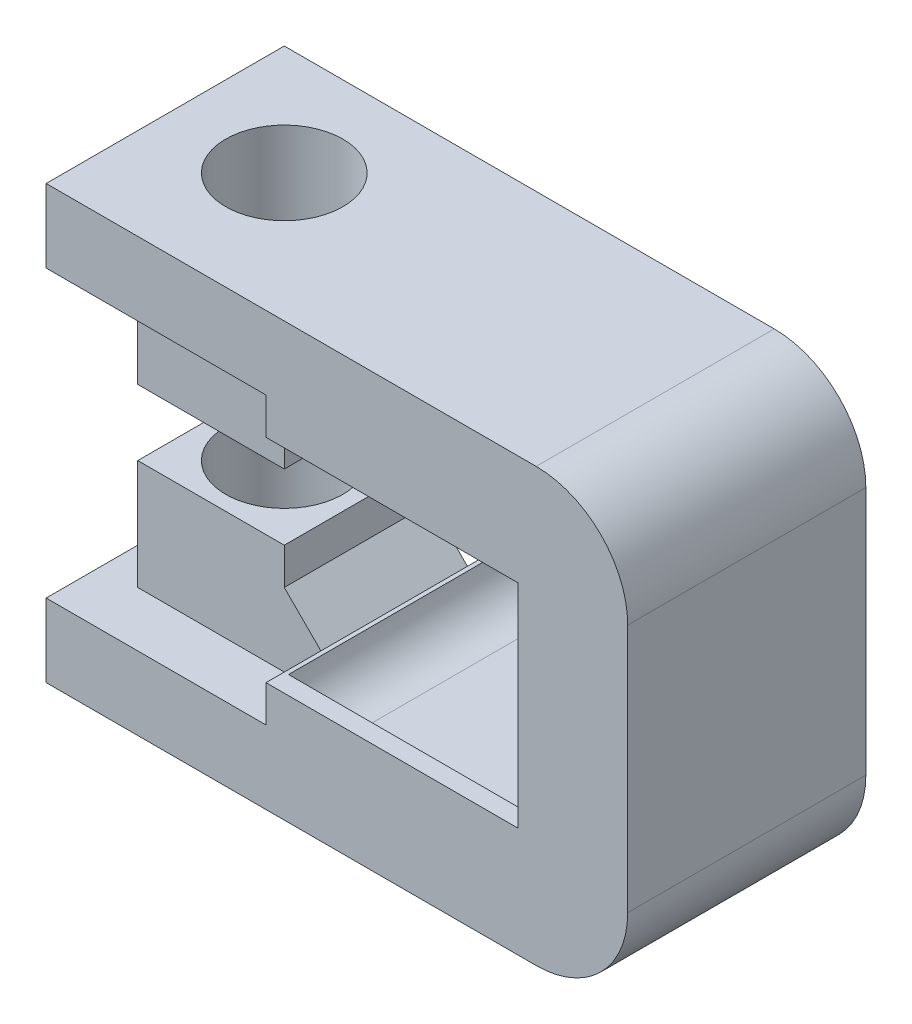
ISO-10303-21;
HEADER;
FILE_DESCRIPTION(('STEP AP214'),'2;1');
FILE_NAME('part.step','',(''),(''),'','','');
FILE_SCHEMA(('AUTOMOTIVE_DESIGN { 1 0 10303 214 1 1 1 1 }'));
ENDSEC;
DATA;
#1=APPLICATION_CONTEXT('core data for automotive mechanical design processes');
#2=APPLICATION_PROTOCOL_DEFINITION('international standard','automotive_design',2000,#1);
#3=PRODUCT_CONTEXT('',#1,'mechanical');
#4=PRODUCT('Part','Part','',(#3));
#5=PRODUCT_RELATED_PRODUCT_CATEGORY('part','',(#4));
#6=PRODUCT_DEFINITION_FORMATION('','',#4);
#7=PRODUCT_DEFINITION_CONTEXT('part definition',#1,'design');
#8=PRODUCT_DEFINITION('design','',#6,#7);
#9=PRODUCT_DEFINITION_SHAPE('','',#8);
#10=(LENGTH_UNIT() NAMED_UNIT(*) SI_UNIT(.MILLI.,.METRE.));
#11=(NAMED_UNIT(*) PLANE_ANGLE_UNIT() SI_UNIT($,.RADIAN.));
#12=(NAMED_UNIT(*) SI_UNIT($,.STERADIAN.) SOLID_ANGLE_UNIT());
#13=UNCERTAINTY_MEASURE_WITH_UNIT(LENGTH_MEASURE(1.E-05),#10,'distance_accuracy_value','');
#14=(GEOMETRIC_REPRESENTATION_CONTEXT(3) GLOBAL_UNCERTAINTY_ASSIGNED_CONTEXT((#13)) GLOBAL_UNIT_ASSIGNED_CONTEXT((#10,
#11,#12)) REPRESENTATION_CONTEXT('',''));
#15=CARTESIAN_POINT('',(0.,0.,0.));
#16=DIRECTION('',(0.,0.,1.));
#17=DIRECTION('',(1.,0.,0.));
#18=AXIS2_PLACEMENT_3D('',#15,#16,#17);
#19=CARTESIAN_POINT('',(-7.95000000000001,0.,-12.));
#20=DIRECTION('',(1.,0.,0.));
#21=DIRECTION('',(0.,0.,-1.));
#22=AXIS2_PLACEMENT_3D('',#19,#20,#21);
#23=PLANE('',#22);
#24=DIRECTION('',(0.,1.,0.));
#25=VECTOR('',#24,1.);
#26=CARTESIAN_POINT('',(-7.95,-2.44621125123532,-2.));
#27=LINE('',#26,#25);
#28=CARTESIAN_POINT('',(-7.95000000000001,5.8,-2.));
#29=VERTEX_POINT('',#28);
#30=CARTESIAN_POINT('',(-7.95000000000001,7.8,-2.));
#31=VERTEX_POINT('',#30);
#32=EDGE_CURVE('E567',#29,#31,#27,.T.);
#33=ORIENTED_EDGE('',*,*,#32,.F.);
#34=DIRECTION('',(0.,0.,1.));
#35=VECTOR('',#34,1.);
#36=CARTESIAN_POINT('',(-7.95000000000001,5.8,-12.));
#37=LINE('',#36,#35);
#38=CARTESIAN_POINT('',(-7.95000000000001,5.8,1.));
#39=VERTEX_POINT('',#38);
#40=EDGE_CURVE('E460',#29,#39,#37,.T.);
#41=ORIENTED_EDGE('',*,*,#40,.T.);
#42=DIRECTION('',(0.,1.,0.));
#43=VECTOR('',#42,1.);
#44=CARTESIAN_POINT('',(-7.95000000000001,0.,1.));
#45=LINE('',#44,#43);
#46=CARTESIAN_POINT('',(-7.95000000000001,7.8,1.));
#47=VERTEX_POINT('',#46);
#48=EDGE_CURVE('E346',#39,#47,#45,.T.);
#49=ORIENTED_EDGE('',*,*,#48,.T.);
#50=DIRECTION('',(0.,0.,1.));
#51=VECTOR('',#50,1.);
#52=CARTESIAN_POINT('',(-7.95000000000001,7.8,-12.));
#53=LINE('',#52,#51);
#54=EDGE_CURVE('E464',#31,#47,#53,.T.);
#55=ORIENTED_EDGE('',*,*,#54,.F.);
#56=EDGE_LOOP('',(#33,#41,#49,#55));
#57=FACE_BOUND('',#56,.T.);
#58=ADVANCED_FACE('F40',(#57),#23,.F.);
#59=DIRECTION('',(0.,1.,0.));
#60=VECTOR('',#59,1.);
#61=CARTESIAN_POINT('',(-7.95,-2.44621125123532,-10.));
#62=LINE('',#61,#60);
#63=CARTESIAN_POINT('',(-7.95000000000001,5.8,-10.));
#64=VERTEX_POINT('',#63);
#65=CARTESIAN_POINT('',(-7.95000000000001,7.8,-10.));
#66=VERTEX_POINT('',#65);
#67=EDGE_CURVE('E581',#64,#66,#62,.T.);
#68=ORIENTED_EDGE('',*,*,#67,.T.);
#69=CARTESIAN_POINT('',(-7.95000000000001,7.8,-12.));
#70=VERTEX_POINT('',#69);
#71=EDGE_CURVE('E461',#70,#66,#53,.T.);
#72=ORIENTED_EDGE('',*,*,#71,.F.);
#73=DIRECTION('',(0.,1.,0.));
#74=VECTOR('',#73,1.);
#75=CARTESIAN_POINT('',(-7.95000000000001,0.,-12.));
#76=LINE('',#75,#74);
#77=CARTESIAN_POINT('',(-7.95000000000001,5.8,-12.));
#78=VERTEX_POINT('',#77);
#79=EDGE_CURVE('E426',#78,#70,#76,.T.);
#80=ORIENTED_EDGE('',*,*,#79,.F.);
#81=EDGE_CURVE('E457',#78,#64,#37,.T.);
#82=ORIENTED_EDGE('',*,*,#81,.T.);
#83=EDGE_LOOP('',(#68,#72,#80,#82));
#84=FACE_BOUND('',#83,.T.);
#85=ADVANCED_FACE('F584',(#84),#23,.F.);
#86=CARTESIAN_POINT('',(0.,7.8,-12.));
#87=DIRECTION('',(0.,1.,0.));
#88=DIRECTION('',(-1.,0.,0.));
#89=AXIS2_PLACEMENT_3D('',#86,#87,#88);
#90=PLANE('',#89);
#91=DIRECTION('',(1.,0.,0.));
#92=VECTOR('',#91,1.);
#93=CARTESIAN_POINT('',(0.,7.8,-2.));
#94=LINE('',#93,#92);
#95=CARTESIAN_POINT('',(-17.95,7.8,-2.));
#96=VERTEX_POINT('',#95);
#97=EDGE_CURVE('E306',#96,#31,#94,.T.);
#98=ORIENTED_EDGE('',*,*,#97,.T.);
#99=ORIENTED_EDGE('',*,*,#54,.T.);
#100=DIRECTION('',(-1.,0.,0.));
#101=VECTOR('',#100,1.);
#102=CARTESIAN_POINT('',(0.,7.8,1.));
#103=LINE('',#102,#101);
#104=CARTESIAN_POINT('',(-19.95,7.8,1.));
#105=VERTEX_POINT('',#104);
#106=EDGE_CURVE('E343',#47,#105,#103,.T.);
#107=ORIENTED_EDGE('',*,*,#106,.T.);
#108=DIRECTION('',(0.,0.,1.));
#109=VECTOR('',#108,1.);
#110=CARTESIAN_POINT('',(-19.95,7.8,-12.));
#111=LINE('',#110,#109);
#112=CARTESIAN_POINT('',(-19.95,7.8,-12.));
#113=VERTEX_POINT('',#112);
#114=EDGE_CURVE('E465',#113,#105,#111,.T.);
#115=ORIENTED_EDGE('',*,*,#114,.F.);
#116=DIRECTION('',(-1.,0.,0.));
#117=VECTOR('',#116,1.);
#118=CARTESIAN_POINT('',(0.,7.8,-12.));
#119=LINE('',#118,#117);
#120=EDGE_CURVE('E395',#70,#113,#119,.T.);
#121=ORIENTED_EDGE('',*,*,#120,.F.);
#122=ORIENTED_EDGE('',*,*,#71,.T.);
#123=DIRECTION('',(1.,0.,0.));
#124=VECTOR('',#123,1.);
#125=CARTESIAN_POINT('',(0.,7.8,-10.));
#126=LINE('',#125,#124);
#127=CARTESIAN_POINT('',(-17.95,7.8,-10.));
#128=VERTEX_POINT('',#127);
#129=EDGE_CURVE('E297',#128,#66,#126,.T.);
#130=ORIENTED_EDGE('',*,*,#129,.F.);
#131=DIRECTION('',(0.,0.,-1.));
#132=VECTOR('',#131,1.);
#133=CARTESIAN_POINT('',(-17.95,7.8,-12.));
#134=LINE('',#133,#132);
#135=EDGE_CURVE('E303',#96,#128,#134,.T.);
#136=ORIENTED_EDGE('',*,*,#135,.F.);
#137=EDGE_LOOP('',(#98,#99,#107,#115,#121,#122,#130,#136));
#138=FACE_BOUND('',#137,.T.);
#139=ADVANCED_FACE('F588',(#138),#90,.F.);
#140=CARTESIAN_POINT('',(-9.95,1.8,0.));
#141=DIRECTION('',(1.,0.,0.));
#142=DIRECTION('',(0.,0.,-1.));
#143=AXIS2_PLACEMENT_3D('',#140,#141,#142);
#144=PLANE('',#143);
#145=DIRECTION('',(0.,1.,0.));
#146=VECTOR('',#145,1.);
#147=CARTESIAN_POINT('',(-9.95,1.8,-10.));
#148=LINE('',#147,#146);
#149=CARTESIAN_POINT('',(-9.95,1.8,-10.));
#150=VERTEX_POINT('',#149);
#151=CARTESIAN_POINT('',(-9.95,3.8,-10.));
#152=VERTEX_POINT('',#151);
#153=EDGE_CURVE('E275',#150,#152,#148,.T.);
#154=ORIENTED_EDGE('',*,*,#153,.T.);
#155=DIRECTION('',(0.,0.,1.));
#156=VECTOR('',#155,1.);
#157=CARTESIAN_POINT('',(-9.95,3.8,0.));
#158=LINE('',#157,#156);
#159=CARTESIAN_POINT('',(-9.95,3.8,-2.));
#160=VERTEX_POINT('',#159);
#161=EDGE_CURVE('E516',#152,#160,#158,.T.);
#162=ORIENTED_EDGE('',*,*,#161,.T.);
#163=DIRECTION('',(0.,1.,0.));
#164=VECTOR('',#163,1.);
#165=CARTESIAN_POINT('',(-9.95,1.8,-2.));
#166=LINE('',#165,#164);
#167=CARTESIAN_POINT('',(-9.95,1.8,-2.));
#168=VERTEX_POINT('',#167);
#169=EDGE_CURVE('E286',#168,#160,#166,.T.);
#170=ORIENTED_EDGE('',*,*,#169,.F.);
#171=DIRECTION('',(0.,0.,-1.));
#172=VECTOR('',#171,1.);
#173=CARTESIAN_POINT('',(-9.95,1.8,0.));
#174=LINE('',#173,#172);
#175=EDGE_CURVE('E266',#168,#150,#174,.T.);
#176=ORIENTED_EDGE('',*,*,#175,.T.);
#177=EDGE_LOOP('',(#154,#162,#170,#176));
#178=FACE_BOUND('',#177,.T.);
#179=ADVANCED_FACE('F284',(#178),#144,.T.);
#180=CARTESIAN_POINT('',(0.,-7.8,-12.));
#181=DIRECTION('',(0.,-1.,0.));
#182=DIRECTION('',(0.,0.,-1.));
#183=AXIS2_PLACEMENT_3D('',#180,#181,#182);
#184=PLANE('',#183);
#185=DIRECTION('',(0.,0.,1.));
#186=VECTOR('',#185,1.);
#187=CARTESIAN_POINT('',(-7.95,-7.8,-12.));
#188=LINE('',#187,#186);
#189=CARTESIAN_POINT('',(-7.95,-7.8,-2.));
#190=VERTEX_POINT('',#189);
#191=CARTESIAN_POINT('',(-7.95,-7.8,1.));
#192=VERTEX_POINT('',#191);
#193=EDGE_CURVE('E477',#190,#192,#188,.T.);
#194=ORIENTED_EDGE('',*,*,#193,.F.);
#195=DIRECTION('',(1.,0.,0.));
#196=VECTOR('',#195,1.);
#197=CARTESIAN_POINT('',(0.,-7.8,-2.));
#198=LINE('',#197,#196);
#199=CARTESIAN_POINT('',(-17.95,-7.8,-2.));
#200=VERTEX_POINT('',#199);
#201=EDGE_CURVE('E453',#200,#190,#198,.T.);
#202=ORIENTED_EDGE('',*,*,#201,.F.);
#203=DIRECTION('',(0.,0.,-1.));
#204=VECTOR('',#203,1.);
#205=CARTESIAN_POINT('',(-17.95,-7.8,-12.));
#206=LINE('',#205,#204);
#207=CARTESIAN_POINT('',(-17.95,-7.8,-10.));
#208=VERTEX_POINT('',#207);
#209=EDGE_CURVE('E500',#200,#208,#206,.T.);
#210=ORIENTED_EDGE('',*,*,#209,.T.);
#211=DIRECTION('',(1.,0.,0.));
#212=VECTOR('',#211,1.);
#213=CARTESIAN_POINT('',(0.,-7.8,-10.));
#214=LINE('',#213,#212);
#215=CARTESIAN_POINT('',(-7.95,-7.8,-10.));
#216=VERTEX_POINT('',#215);
#217=EDGE_CURVE('E502',#208,#216,#214,.T.);
#218=ORIENTED_EDGE('',*,*,#217,.T.);
#219=CARTESIAN_POINT('',(-7.95,-7.8,-12.));
#220=VERTEX_POINT('',#219);
#221=EDGE_CURVE('E474',#220,#216,#188,.T.);
#222=ORIENTED_EDGE('',*,*,#221,.F.);
#223=DIRECTION('',(1.,0.,0.));
#224=VECTOR('',#223,1.);
#225=CARTESIAN_POINT('',(0.,-7.8,-12.));
#226=LINE('',#225,#224);
#227=CARTESIAN_POINT('',(-19.95,-7.8,-12.));
#228=VERTEX_POINT('',#227);
#229=EDGE_CURVE('E406',#228,#220,#226,.T.);
#230=ORIENTED_EDGE('',*,*,#229,.F.);
#231=DIRECTION('',(0.,0.,1.));
#232=VECTOR('',#231,1.);
#233=CARTESIAN_POINT('',(-19.95,-7.8,-12.));
#234=LINE('',#233,#232);
#235=CARTESIAN_POINT('',(-19.95,-7.8,1.));
#236=VERTEX_POINT('',#235);
#237=EDGE_CURVE('E472',#228,#236,#234,.T.);
#238=ORIENTED_EDGE('',*,*,#237,.T.);
#239=DIRECTION('',(1.,0.,0.));
#240=VECTOR('',#239,1.);
#241=CARTESIAN_POINT('',(0.,-7.8,1.));
#242=LINE('',#241,#240);
#243=EDGE_CURVE('E362',#236,#192,#242,.T.);
#244=ORIENTED_EDGE('',*,*,#243,.T.);
#245=EDGE_LOOP('',(#194,#202,#210,#218,#222,#230,#238,#244));
#246=FACE_BOUND('',#245,.T.);
#247=ADVANCED_FACE('F614',(#246),#184,.F.);
#248=CARTESIAN_POINT('',(-7.95,0.,-12.));
#249=DIRECTION('',(-1.,0.,0.));
#250=DIRECTION('',(0.,0.,1.));
#251=AXIS2_PLACEMENT_3D('',#248,#249,#250);
#252=PLANE('',#251);
#253=DIRECTION('',(0.,0.,1.));
#254=VECTOR('',#253,1.);
#255=CARTESIAN_POINT('',(-7.95,-5.8,-12.));
#256=LINE('',#255,#254);
#257=CARTESIAN_POINT('',(-7.95,-5.8,-2.));
#258=VERTEX_POINT('',#257);
#259=CARTESIAN_POINT('',(-7.95,-5.8,1.));
#260=VERTEX_POINT('',#259);
#261=EDGE_CURVE('E481',#258,#260,#256,.T.);
#262=ORIENTED_EDGE('',*,*,#261,.F.);
#263=DIRECTION('',(0.,-1.,0.));
#264=VECTOR('',#263,1.);
#265=CARTESIAN_POINT('',(-7.95,2.44621125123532,-2.));
#266=LINE('',#265,#264);
#267=EDGE_CURVE('E309',#258,#190,#266,.T.);
#268=ORIENTED_EDGE('',*,*,#267,.T.);
#269=ORIENTED_EDGE('',*,*,#193,.T.);
#270=DIRECTION('',(0.,-1.,0.));
#271=VECTOR('',#270,1.);
#272=CARTESIAN_POINT('',(-7.95,0.,1.));
#273=LINE('',#272,#271);
#274=EDGE_CURVE('E359',#260,#192,#273,.T.);
#275=ORIENTED_EDGE('',*,*,#274,.F.);
#276=EDGE_LOOP('',(#262,#268,#269,#275));
#277=FACE_BOUND('',#276,.T.);
#278=ADVANCED_FACE('F610',(#277),#252,.T.);
#279=ORIENTED_EDGE('',*,*,#221,.T.);
#280=DIRECTION('',(0.,-1.,0.));
#281=VECTOR('',#280,1.);
#282=CARTESIAN_POINT('',(-7.95,2.44621125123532,-10.));
#283=LINE('',#282,#281);
#284=CARTESIAN_POINT('',(-7.95,-5.8,-10.));
#285=VERTEX_POINT('',#284);
#286=EDGE_CURVE('E308',#285,#216,#283,.T.);
#287=ORIENTED_EDGE('',*,*,#286,.F.);
#288=CARTESIAN_POINT('',(-7.95,-5.8,-12.));
#289=VERTEX_POINT('',#288);
#290=EDGE_CURVE('E478',#289,#285,#256,.T.);
#291=ORIENTED_EDGE('',*,*,#290,.F.);
#292=DIRECTION('',(0.,-1.,0.));
#293=VECTOR('',#292,1.);
#294=CARTESIAN_POINT('',(-7.95,0.,-12.));
#295=LINE('',#294,#293);
#296=EDGE_CURVE('E410',#289,#220,#295,.T.);
#297=ORIENTED_EDGE('',*,*,#296,.T.);
#298=EDGE_LOOP('',(#279,#287,#291,#297));
#299=FACE_BOUND('',#298,.T.);
#300=ADVANCED_FACE('F624',(#299),#252,.T.);
#301=CARTESIAN_POINT('',(-9.95,-1.8,0.));
#302=DIRECTION('',(-1.,0.,0.));
#303=DIRECTION('',(0.,0.,1.));
#304=AXIS2_PLACEMENT_3D('',#301,#302,#303);
#305=PLANE('',#304);
#306=DIRECTION('',(0.,-1.,0.));
#307=VECTOR('',#306,1.);
#308=CARTESIAN_POINT('',(-9.95,-1.8,-2.));
#309=LINE('',#308,#307);
#310=CARTESIAN_POINT('',(-9.95,-1.8,-2.));
#311=VERTEX_POINT('',#310);
#312=CARTESIAN_POINT('',(-9.95,-3.80000000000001,-2.));
#313=VERTEX_POINT('',#312);
#314=EDGE_CURVE('E330',#311,#313,#309,.T.);
#315=ORIENTED_EDGE('',*,*,#314,.T.);
#316=DIRECTION('',(0.,0.,-1.));
#317=VECTOR('',#316,1.);
#318=CARTESIAN_POINT('',(-9.95,-3.80000000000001,-10.));
#319=LINE('',#318,#317);
#320=CARTESIAN_POINT('',(-9.95,-3.80000000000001,-10.));
#321=VERTEX_POINT('',#320);
#322=EDGE_CURVE('E507',#313,#321,#319,.T.);
#323=ORIENTED_EDGE('',*,*,#322,.T.);
#324=DIRECTION('',(0.,-1.,0.));
#325=VECTOR('',#324,1.);
#326=CARTESIAN_POINT('',(-9.95,-1.8,-10.));
#327=LINE('',#326,#325);
#328=CARTESIAN_POINT('',(-9.95,-1.8,-10.));
#329=VERTEX_POINT('',#328);
#330=EDGE_CURVE('E331',#329,#321,#327,.T.);
#331=ORIENTED_EDGE('',*,*,#330,.F.);
#332=DIRECTION('',(0.,0.,-1.));
#333=VECTOR('',#332,1.);
#334=CARTESIAN_POINT('',(-9.95,-1.8,0.));
#335=LINE('',#334,#333);
#336=EDGE_CURVE('E320',#311,#329,#335,.T.);
#337=ORIENTED_EDGE('',*,*,#336,.F.);
#338=EDGE_LOOP('',(#315,#323,#331,#337));
#339=FACE_BOUND('',#338,.T.);
#340=ADVANCED_FACE('F651',(#339),#305,.F.);
#341=DIRECTION('',(-1.,0.,0.));
#342=VECTOR('',#341,1.);
#343=CARTESIAN_POINT('',(0.,7.8,0.));
#344=LINE('',#343,#342);
#345=CARTESIAN_POINT('',(5.15,7.8,0.));
#346=VERTEX_POINT('',#345);
#347=CARTESIAN_POINT('',(-5.15,7.8,0.));
#348=VERTEX_POINT('',#347);
#349=EDGE_CURVE('E389',#346,#348,#344,.T.);
#350=ORIENTED_EDGE('',*,*,#349,.T.);
#351=DIRECTION('',(0.,0.,1.));
#352=VECTOR('',#351,1.);
#353=CARTESIAN_POINT('',(-5.15,7.8,-12.));
#354=LINE('',#353,#352);
#355=CARTESIAN_POINT('',(-5.15,7.8,-12.));
#356=VERTEX_POINT('',#355);
#357=EDGE_CURVE('E450',#356,#348,#354,.T.);
#358=ORIENTED_EDGE('',*,*,#357,.F.);
#359=CARTESIAN_POINT('',(5.15,7.8,-12.));
#360=VERTEX_POINT('',#359);
#361=EDGE_CURVE('E390',#360,#356,#119,.T.);
#362=ORIENTED_EDGE('',*,*,#361,.F.);
#363=DIRECTION('',(0.,0.,1.));
#364=VECTOR('',#363,1.);
#365=CARTESIAN_POINT('',(5.15,7.8,-12.));
#366=LINE('',#365,#364);
#367=EDGE_CURVE('E432',#360,#346,#366,.T.);
#368=ORIENTED_EDGE('',*,*,#367,.T.);
#369=EDGE_LOOP('',(#350,#358,#362,#368));
#370=FACE_BOUND('',#369,.T.);
#371=ADVANCED_FACE('F649',(#370),#90,.F.);
#372=CARTESIAN_POINT('',(-5.15,5.15,-12.));
#373=DIRECTION('',(0.,0.,1.));
#374=DIRECTION('',(1.,0.,0.));
#375=AXIS2_PLACEMENT_3D('',#372,#373,#374);
#376=CYLINDRICAL_SURFACE('',#375,2.65);
#377=CARTESIAN_POINT('',(-5.15,5.15,0.));
#378=DIRECTION('',(0.,0.,1.));
#379=DIRECTION('',(1.,0.,0.));
#380=AXIS2_PLACEMENT_3D('',#377,#378,#379);
#381=CIRCLE('',#380,2.65);
#382=CARTESIAN_POINT('',(-7.71904651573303,5.8,0.));
#383=VERTEX_POINT('',#382);
#384=EDGE_CURVE('E394',#348,#383,#381,.T.);
#385=ORIENTED_EDGE('',*,*,#384,.T.);
#386=DIRECTION('',(0.,0.,1.));
#387=VECTOR('',#386,1.);
#388=CARTESIAN_POINT('',(-7.71904651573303,5.8,-12.));
#389=LINE('',#388,#387);
#390=CARTESIAN_POINT('',(-7.71904651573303,5.8,-12.));
#391=VERTEX_POINT('',#390);
#392=EDGE_CURVE('E454',#391,#383,#389,.T.);
#393=ORIENTED_EDGE('',*,*,#392,.F.);
#394=CARTESIAN_POINT('',(-5.15,5.15,-12.));
#395=DIRECTION('',(0.,0.,1.));
#396=DIRECTION('',(1.,0.,0.));
#397=AXIS2_PLACEMENT_3D('',#394,#395,#396);
#398=CIRCLE('',#397,2.65);
#399=EDGE_CURVE('E430',#356,#391,#398,.T.);
#400=ORIENTED_EDGE('',*,*,#399,.F.);
#401=ORIENTED_EDGE('',*,*,#357,.T.);
#402=EDGE_LOOP('',(#385,#393,#400,#401));
#403=FACE_BOUND('',#402,.T.);
#404=ADVANCED_FACE('F593',(#403),#376,.F.);
#405=CARTESIAN_POINT('',(0.,5.8,-12.));
#406=DIRECTION('',(0.,1.,0.));
#407=DIRECTION('',(-1.,0.,0.));
#408=AXIS2_PLACEMENT_3D('',#405,#406,#407);
#409=PLANE('',#408);
#410=ORIENTED_EDGE('',*,*,#40,.F.);
#411=DIRECTION('',(0.,0.,-1.));
#412=VECTOR('',#411,1.);
#413=CARTESIAN_POINT('',(-7.94999999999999,5.8,-12.));
#414=LINE('',#413,#412);
#415=EDGE_CURVE('E513',#29,#64,#414,.T.);
#416=ORIENTED_EDGE('',*,*,#415,.T.);
#417=ORIENTED_EDGE('',*,*,#81,.F.);
#418=DIRECTION('',(-1.,0.,0.));
#419=VECTOR('',#418,1.);
#420=CARTESIAN_POINT('',(0.,5.8,-12.));
#421=LINE('',#420,#419);
#422=EDGE_CURVE('E428',#391,#78,#421,.T.);
#423=ORIENTED_EDGE('',*,*,#422,.F.);
#424=ORIENTED_EDGE('',*,*,#392,.T.);
#425=DIRECTION('',(-1.,0.,0.));
#426=VECTOR('',#425,1.);
#427=CARTESIAN_POINT('',(0.,5.8,0.));
#428=LINE('',#427,#426);
#429=CARTESIAN_POINT('',(5.8,5.8,0.));
#430=VERTEX_POINT('',#429);
#431=EDGE_CURVE('E334',#430,#383,#428,.T.);
#432=ORIENTED_EDGE('',*,*,#431,.F.);
#433=DIRECTION('',(0.,0.,-1.));
#434=VECTOR('',#433,1.);
#435=CARTESIAN_POINT('',(5.8,5.8,1.));
#436=LINE('',#435,#434);
#437=CARTESIAN_POINT('',(5.8,5.8,1.));
#438=VERTEX_POINT('',#437);
#439=EDGE_CURVE('E387',#438,#430,#436,.T.);
#440=ORIENTED_EDGE('',*,*,#439,.F.);
#441=DIRECTION('',(-1.,0.,0.));
#442=VECTOR('',#441,1.);
#443=CARTESIAN_POINT('',(0.,5.8,1.));
#444=LINE('',#443,#442);
#445=EDGE_CURVE('E350',#438,#39,#444,.T.);
#446=ORIENTED_EDGE('',*,*,#445,.T.);
#447=EDGE_LOOP('',(#410,#416,#417,#423,#424,#432,#440,#446));
#448=FACE_BOUND('',#447,.T.);
#449=ADVANCED_FACE('F570',(#448),#409,.F.);
#450=CARTESIAN_POINT('',(-19.95,0.,-12.));
#451=DIRECTION('',(1.,0.,0.));
#452=DIRECTION('',(0.,0.,-1.));
#453=AXIS2_PLACEMENT_3D('',#450,#451,#452);
#454=PLANE('',#453);
#455=ORIENTED_EDGE('',*,*,#114,.T.);
#456=DIRECTION('',(0.,1.,0.));
#457=VECTOR('',#456,1.);
#458=CARTESIAN_POINT('',(-19.95,0.,1.));
#459=LINE('',#458,#457);
#460=CARTESIAN_POINT('',(-19.95,11.8,1.));
#461=VERTEX_POINT('',#460);
#462=EDGE_CURVE('E376',#105,#461,#459,.T.);
#463=ORIENTED_EDGE('',*,*,#462,.T.);
#464=DIRECTION('',(0.,0.,1.));
#465=VECTOR('',#464,1.);
#466=CARTESIAN_POINT('',(-19.95,11.8,-12.));
#467=LINE('',#466,#465);
#468=CARTESIAN_POINT('',(-19.95,11.8,-12.));
#469=VERTEX_POINT('',#468);
#470=EDGE_CURVE('E467',#469,#461,#467,.T.);
#471=ORIENTED_EDGE('',*,*,#470,.F.);
#472=DIRECTION('',(0.,1.,0.));
#473=VECTOR('',#472,1.);
#474=CARTESIAN_POINT('',(-19.95,0.,-12.));
#475=LINE('',#474,#473);
#476=EDGE_CURVE('E423',#113,#469,#475,.T.);
#477=ORIENTED_EDGE('',*,*,#476,.F.);
#478=EDGE_LOOP('',(#455,#463,#471,#477));
#479=FACE_BOUND('',#478,.T.);
#480=ADVANCED_FACE('F556',(#479),#454,.F.);
#481=CARTESIAN_POINT('',(0.,11.8,-12.));
#482=DIRECTION('',(0.,1.,0.));
#483=DIRECTION('',(-1.,0.,0.));
#484=AXIS2_PLACEMENT_3D('',#481,#482,#483);
#485=PLANE('',#484);
#486=CARTESIAN_POINT('',(-13.95,11.8,-6.));
#487=DIRECTION('',(0.,-1.,0.));
#488=DIRECTION('',(0.,0.,-1.));
#489=AXIS2_PLACEMENT_3D('',#486,#487,#488);
#490=CIRCLE('',#489,3.2);
#491=CARTESIAN_POINT('',(-13.95,11.8,-9.2));
#492=VERTEX_POINT('',#491);
#493=EDGE_CURVE('E290',#492,#492,#490,.T.);
#494=ORIENTED_EDGE('',*,*,#493,.T.);
#495=EDGE_LOOP('',(#494));
#496=FACE_BOUND('',#495,.T.);
#497=DIRECTION('',(-1.,0.,0.));
#498=VECTOR('',#497,1.);
#499=CARTESIAN_POINT('',(0.,11.8,1.));
#500=LINE('',#499,#498);
#501=CARTESIAN_POINT('',(6.8,11.8,1.));
#502=VERTEX_POINT('',#501);
#503=EDGE_CURVE('E374',#502,#461,#500,.T.);
#504=ORIENTED_EDGE('',*,*,#503,.F.);
#505=DIRECTION('',(0.,0.,1.));
#506=VECTOR('',#505,1.);
#507=CARTESIAN_POINT('',(6.8,11.8,-12.));
#508=LINE('',#507,#506);
#509=CARTESIAN_POINT('',(6.8,11.8,-12.));
#510=VERTEX_POINT('',#509);
#511=EDGE_CURVE('E11',#502,#510,#508,.F.);
#512=ORIENTED_EDGE('',*,*,#511,.T.);
#513=DIRECTION('',(-1.,0.,0.));
#514=VECTOR('',#513,1.);
#515=CARTESIAN_POINT('',(0.,11.8,-12.));
#516=LINE('',#515,#514);
#517=EDGE_CURVE('E421',#510,#469,#516,.T.);
#518=ORIENTED_EDGE('',*,*,#517,.T.);
#519=ORIENTED_EDGE('',*,*,#470,.T.);
#520=EDGE_LOOP('',(#504,#512,#518,#519));
#521=FACE_BOUND('',#520,.T.);
#522=ADVANCED_FACE('F552',(#496,#521),#485,.T.);
#523=CARTESIAN_POINT('',(11.8,0.,-12.));
#524=DIRECTION('',(1.,0.,0.));
#525=DIRECTION('',(0.,1.,0.));
#526=AXIS2_PLACEMENT_3D('',#523,#524,#525);
#527=PLANE('',#526);
#528=DIRECTION('',(0.,1.,0.));
#529=VECTOR('',#528,1.);
#530=CARTESIAN_POINT('',(11.8,0.,1.));
#531=LINE('',#530,#529);
#532=CARTESIAN_POINT('',(11.8,-6.8,1.));
#533=VERTEX_POINT('',#532);
#534=CARTESIAN_POINT('',(11.8,6.8,1.));
#535=VERTEX_POINT('',#534);
#536=EDGE_CURVE('E371',#533,#535,#531,.T.);
#537=ORIENTED_EDGE('',*,*,#536,.F.);
#538=DIRECTION('',(0.,0.,1.));
#539=VECTOR('',#538,1.);
#540=CARTESIAN_POINT('',(11.8,-6.8,-12.));
#541=LINE('',#540,#539);
#542=CARTESIAN_POINT('',(11.8,-6.8,-12.));
#543=VERTEX_POINT('',#542);
#544=EDGE_CURVE('E531',#533,#543,#541,.F.);
#545=ORIENTED_EDGE('',*,*,#544,.T.);
#546=DIRECTION('',(0.,1.,0.));
#547=VECTOR('',#546,1.);
#548=CARTESIAN_POINT('',(11.8,0.,-12.));
#549=LINE('',#548,#547);
#550=CARTESIAN_POINT('',(11.8,6.8,-12.));
#551=VERTEX_POINT('',#550);
#552=EDGE_CURVE('E419',#543,#551,#549,.T.);
#553=ORIENTED_EDGE('',*,*,#552,.T.);
#554=DIRECTION('',(0.,0.,1.));
#555=VECTOR('',#554,1.);
#556=CARTESIAN_POINT('',(11.8,6.8,-12.));
#557=LINE('',#556,#555);
#558=EDGE_CURVE('E528',#551,#535,#557,.T.);
#559=ORIENTED_EDGE('',*,*,#558,.T.);
#560=EDGE_LOOP('',(#537,#545,#553,#559));
#561=FACE_BOUND('',#560,.T.);
#562=ADVANCED_FACE('F548',(#561),#527,.T.);
#563=CARTESIAN_POINT('',(0.,-11.8,-12.));
#564=DIRECTION('',(0.,-1.,0.));
#565=DIRECTION('',(0.,0.,-1.));
#566=AXIS2_PLACEMENT_3D('',#563,#564,#565);
#567=PLANE('',#566);
#568=CARTESIAN_POINT('',(-13.95,-11.8,-6.));
#569=DIRECTION('',(0.,-1.,0.));
#570=DIRECTION('',(0.,0.,-1.));
#571=AXIS2_PLACEMENT_3D('',#568,#569,#570);
#572=CIRCLE('',#571,3.2);
#573=CARTESIAN_POINT('',(-13.95,-11.8,-9.2));
#574=VERTEX_POINT('',#573);
#575=EDGE_CURVE('E312',#574,#574,#572,.T.);
#576=ORIENTED_EDGE('',*,*,#575,.F.);
#577=EDGE_LOOP('',(#576));
#578=FACE_BOUND('',#577,.T.);
#579=DIRECTION('',(1.,0.,0.));
#580=VECTOR('',#579,1.);
#581=CARTESIAN_POINT('',(0.,-11.8,-12.));
#582=LINE('',#581,#580);
#583=CARTESIAN_POINT('',(-19.95,-11.8,-12.));
#584=VERTEX_POINT('',#583);
#585=CARTESIAN_POINT('',(6.8,-11.8,-12.));
#586=VERTEX_POINT('',#585);
#587=EDGE_CURVE('E416',#584,#586,#582,.T.);
#588=ORIENTED_EDGE('',*,*,#587,.T.);
#589=DIRECTION('',(0.,0.,1.));
#590=VECTOR('',#589,1.);
#591=CARTESIAN_POINT('',(6.8,-11.8,-12.));
#592=LINE('',#591,#590);
#593=CARTESIAN_POINT('',(6.8,-11.8,1.));
#594=VERTEX_POINT('',#593);
#595=EDGE_CURVE('E521',#586,#594,#592,.T.);
#596=ORIENTED_EDGE('',*,*,#595,.T.);
#597=DIRECTION('',(1.,0.,0.));
#598=VECTOR('',#597,1.);
#599=CARTESIAN_POINT('',(0.,-11.8,1.));
#600=LINE('',#599,#598);
#601=CARTESIAN_POINT('',(-19.95,-11.8,1.));
#602=VERTEX_POINT('',#601);
#603=EDGE_CURVE('E368',#602,#594,#600,.T.);
#604=ORIENTED_EDGE('',*,*,#603,.F.);
#605=DIRECTION('',(0.,0.,1.));
#606=VECTOR('',#605,1.);
#607=CARTESIAN_POINT('',(-19.95,-11.8,-12.));
#608=LINE('',#607,#606);
#609=EDGE_CURVE('E470',#584,#602,#608,.T.);
#610=ORIENTED_EDGE('',*,*,#609,.F.);
#611=EDGE_LOOP('',(#588,#596,#604,#610));
#612=FACE_BOUND('',#611,.T.);
#613=ADVANCED_FACE('F541',(#578,#612),#567,.T.);
#614=CARTESIAN_POINT('',(-19.95,0.,-12.));
#615=DIRECTION('',(-1.,0.,0.));
#616=DIRECTION('',(0.,0.,1.));
#617=AXIS2_PLACEMENT_3D('',#614,#615,#616);
#618=PLANE('',#617);
#619=ORIENTED_EDGE('',*,*,#609,.T.);
#620=DIRECTION('',(0.,-1.,0.));
#621=VECTOR('',#620,1.);
#622=CARTESIAN_POINT('',(-19.95,0.,1.));
#623=LINE('',#622,#621);
#624=EDGE_CURVE('E365',#236,#602,#623,.T.);
#625=ORIENTED_EDGE('',*,*,#624,.F.);
#626=ORIENTED_EDGE('',*,*,#237,.F.);
#627=DIRECTION('',(0.,-1.,0.));
#628=VECTOR('',#627,1.);
#629=CARTESIAN_POINT('',(-19.95,0.,-12.));
#630=LINE('',#629,#628);
#631=EDGE_CURVE('E413',#228,#584,#630,.T.);
#632=ORIENTED_EDGE('',*,*,#631,.T.);
#633=EDGE_LOOP('',(#619,#625,#626,#632));
#634=FACE_BOUND('',#633,.T.);
#635=ADVANCED_FACE('F619',(#634),#618,.T.);
#636=CARTESIAN_POINT('',(0.,-5.8,-12.));
#637=DIRECTION('',(0.,-1.,0.));
#638=DIRECTION('',(0.,0.,-1.));
#639=AXIS2_PLACEMENT_3D('',#636,#637,#638);
#640=PLANE('',#639);
#641=ORIENTED_EDGE('',*,*,#290,.T.);
#642=DIRECTION('',(0.,0.,1.));
#643=VECTOR('',#642,1.);
#644=CARTESIAN_POINT('',(-7.94999999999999,-5.8,-2.));
#645=LINE('',#644,#643);
#646=EDGE_CURVE('E504',#285,#258,#645,.T.);
#647=ORIENTED_EDGE('',*,*,#646,.T.);
#648=ORIENTED_EDGE('',*,*,#261,.T.);
#649=DIRECTION('',(1.,0.,0.));
#650=VECTOR('',#649,1.);
#651=CARTESIAN_POINT('',(0.,-5.8,1.));
#652=LINE('',#651,#650);
#653=CARTESIAN_POINT('',(5.8,-5.8,1.));
#654=VERTEX_POINT('',#653);
#655=EDGE_CURVE('E356',#260,#654,#652,.T.);
#656=ORIENTED_EDGE('',*,*,#655,.T.);
#657=DIRECTION('',(0.,0.,-1.));
#658=VECTOR('',#657,1.);
#659=CARTESIAN_POINT('',(5.8,-5.8,1.));
#660=LINE('',#659,#658);
#661=CARTESIAN_POINT('',(5.8,-5.8,0.));
#662=VERTEX_POINT('',#661);
#663=EDGE_CURVE('E379',#654,#662,#660,.T.);
#664=ORIENTED_EDGE('',*,*,#663,.T.);
#665=DIRECTION('',(1.,0.,0.));
#666=VECTOR('',#665,1.);
#667=CARTESIAN_POINT('',(0.,-5.8,0.));
#668=LINE('',#667,#666);
#669=CARTESIAN_POINT('',(-7.71904651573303,-5.8,0.));
#670=VERTEX_POINT('',#669);
#671=EDGE_CURVE('E347',#670,#662,#668,.T.);
#672=ORIENTED_EDGE('',*,*,#671,.F.);
#673=DIRECTION('',(0.,0.,1.));
#674=VECTOR('',#673,1.);
#675=CARTESIAN_POINT('',(-7.71904651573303,-5.8,-12.));
#676=LINE('',#675,#674);
#677=CARTESIAN_POINT('',(-7.71904651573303,-5.8,-12.));
#678=VERTEX_POINT('',#677);
#679=EDGE_CURVE('E482',#678,#670,#676,.T.);
#680=ORIENTED_EDGE('',*,*,#679,.F.);
#681=DIRECTION('',(1.,0.,0.));
#682=VECTOR('',#681,1.);
#683=CARTESIAN_POINT('',(0.,-5.8,-12.));
#684=LINE('',#683,#682);
#685=EDGE_CURVE('E408',#289,#678,#684,.T.);
#686=ORIENTED_EDGE('',*,*,#685,.F.);
#687=EDGE_LOOP('',(#641,#647,#648,#656,#664,#672,#680,#686));
#688=FACE_BOUND('',#687,.T.);
#689=ADVANCED_FACE('F604',(#688),#640,.F.);
#690=CARTESIAN_POINT('',(-5.15,-5.15,-12.));
#691=DIRECTION('',(0.,0.,1.));
#692=DIRECTION('',(1.,0.,0.));
#693=AXIS2_PLACEMENT_3D('',#690,#691,#692);
#694=CYLINDRICAL_SURFACE('',#693,2.65);
#695=CARTESIAN_POINT('',(-5.15,-5.15,0.));
#696=DIRECTION('',(0.,0.,1.));
#697=DIRECTION('',(1.,0.,0.));
#698=AXIS2_PLACEMENT_3D('',#695,#696,#697);
#699=CIRCLE('',#698,2.65);
#700=CARTESIAN_POINT('',(-5.15,-7.8,0.));
#701=VERTEX_POINT('',#700);
#702=EDGE_CURVE('E445',#670,#701,#699,.T.);
#703=ORIENTED_EDGE('',*,*,#702,.T.);
#704=DIRECTION('',(0.,0.,1.));
#705=VECTOR('',#704,1.);
#706=CARTESIAN_POINT('',(-5.15,-7.8,-12.));
#707=LINE('',#706,#705);
#708=CARTESIAN_POINT('',(-5.15,-7.8,-12.));
#709=VERTEX_POINT('',#708);
#710=EDGE_CURVE('E485',#709,#701,#707,.T.);
#711=ORIENTED_EDGE('',*,*,#710,.F.);
#712=CARTESIAN_POINT('',(-5.15,-5.15,-12.));
#713=DIRECTION('',(0.,0.,1.));
#714=DIRECTION('',(1.,0.,0.));
#715=AXIS2_PLACEMENT_3D('',#712,#713,#714);
#716=CIRCLE('',#715,2.65);
#717=EDGE_CURVE('E405',#678,#709,#716,.T.);
#718=ORIENTED_EDGE('',*,*,#717,.F.);
#719=ORIENTED_EDGE('',*,*,#679,.T.);
#720=EDGE_LOOP('',(#703,#711,#718,#719));
#721=FACE_BOUND('',#720,.T.);
#722=ADVANCED_FACE('F633',(#721),#694,.F.);
#723=DIRECTION('',(1.,0.,0.));
#724=VECTOR('',#723,1.);
#725=CARTESIAN_POINT('',(0.,-7.8,0.));
#726=LINE('',#725,#724);
#727=CARTESIAN_POINT('',(5.15,-7.8,0.));
#728=VERTEX_POINT('',#727);
#729=EDGE_CURVE('E442',#701,#728,#726,.T.);
#730=ORIENTED_EDGE('',*,*,#729,.T.);
#731=DIRECTION('',(0.,0.,1.));
#732=VECTOR('',#731,1.);
#733=CARTESIAN_POINT('',(5.15,-7.8,-12.));
#734=LINE('',#733,#732);
#735=CARTESIAN_POINT('',(5.15,-7.8,-12.));
#736=VERTEX_POINT('',#735);
#737=EDGE_CURVE('E488',#736,#728,#734,.T.);
#738=ORIENTED_EDGE('',*,*,#737,.F.);
#739=EDGE_CURVE('E403',#709,#736,#226,.T.);
#740=ORIENTED_EDGE('',*,*,#739,.F.);
#741=ORIENTED_EDGE('',*,*,#710,.T.);
#742=EDGE_LOOP('',(#730,#738,#740,#741));
#743=FACE_BOUND('',#742,.T.);
#744=ADVANCED_FACE('F635',(#743),#184,.F.);
#745=CARTESIAN_POINT('',(5.15,-5.15,-12.));
#746=DIRECTION('',(0.,0.,1.));
#747=DIRECTION('',(1.,0.,0.));
#748=AXIS2_PLACEMENT_3D('',#745,#746,#747);
#749=CYLINDRICAL_SURFACE('',#748,2.65);
#750=CARTESIAN_POINT('',(5.15,-5.15,0.));
#751=DIRECTION('',(0.,0.,1.));
#752=DIRECTION('',(1.,0.,0.));
#753=AXIS2_PLACEMENT_3D('',#750,#751,#752);
#754=CIRCLE('',#753,2.65);
#755=CARTESIAN_POINT('',(7.8,-5.15,0.));
#756=VERTEX_POINT('',#755);
#757=EDGE_CURVE('E440',#756,#728,#754,.F.);
#758=ORIENTED_EDGE('',*,*,#757,.F.);
#759=DIRECTION('',(0.,0.,1.));
#760=VECTOR('',#759,1.);
#761=CARTESIAN_POINT('',(7.8,-5.15,-12.));
#762=LINE('',#761,#760);
#763=CARTESIAN_POINT('',(7.8,-5.15,-12.));
#764=VERTEX_POINT('',#763);
#765=EDGE_CURVE('E491',#764,#756,#762,.T.);
#766=ORIENTED_EDGE('',*,*,#765,.F.);
#767=CARTESIAN_POINT('',(5.15,-5.15,-12.));
#768=DIRECTION('',(0.,0.,1.));
#769=DIRECTION('',(1.,0.,0.));
#770=AXIS2_PLACEMENT_3D('',#767,#768,#769);
#771=CIRCLE('',#770,2.65);
#772=EDGE_CURVE('E400',#764,#736,#771,.F.);
#773=ORIENTED_EDGE('',*,*,#772,.T.);
#774=ORIENTED_EDGE('',*,*,#737,.T.);
#775=EDGE_LOOP('',(#758,#766,#773,#774));
#776=FACE_BOUND('',#775,.T.);
#777=ADVANCED_FACE('F638',(#776),#749,.F.);
#778=CARTESIAN_POINT('',(7.8,0.,-12.));
#779=DIRECTION('',(1.,0.,0.));
#780=DIRECTION('',(0.,1.,0.));
#781=AXIS2_PLACEMENT_3D('',#778,#779,#780);
#782=PLANE('',#781);
#783=DIRECTION('',(0.,1.,0.));
#784=VECTOR('',#783,1.);
#785=CARTESIAN_POINT('',(7.8,0.,0.));
#786=LINE('',#785,#784);
#787=CARTESIAN_POINT('',(7.8,5.15,0.));
#788=VERTEX_POINT('',#787);
#789=EDGE_CURVE('E437',#756,#788,#786,.T.);
#790=ORIENTED_EDGE('',*,*,#789,.T.);
#791=DIRECTION('',(0.,0.,1.));
#792=VECTOR('',#791,1.);
#793=CARTESIAN_POINT('',(7.8,5.15,-12.));
#794=LINE('',#793,#792);
#795=CARTESIAN_POINT('',(7.8,5.15,-12.));
#796=VERTEX_POINT('',#795);
#797=EDGE_CURVE('E494',#796,#788,#794,.T.);
#798=ORIENTED_EDGE('',*,*,#797,.F.);
#799=DIRECTION('',(0.,1.,0.));
#800=VECTOR('',#799,1.);
#801=CARTESIAN_POINT('',(7.8,0.,-12.));
#802=LINE('',#801,#800);
#803=EDGE_CURVE('E398',#764,#796,#802,.T.);
#804=ORIENTED_EDGE('',*,*,#803,.F.);
#805=ORIENTED_EDGE('',*,*,#765,.T.);
#806=EDGE_LOOP('',(#790,#798,#804,#805));
#807=FACE_BOUND('',#806,.T.);
#808=ADVANCED_FACE('F643',(#807),#782,.F.);
#809=CARTESIAN_POINT('',(5.15,5.15,-12.));
#810=DIRECTION('',(0.,0.,1.));
#811=DIRECTION('',(1.,0.,0.));
#812=AXIS2_PLACEMENT_3D('',#809,#810,#811);
#813=CYLINDRICAL_SURFACE('',#812,2.65);
#814=CARTESIAN_POINT('',(5.15,5.15,0.));
#815=DIRECTION('',(0.,0.,1.));
#816=DIRECTION('',(1.,0.,0.));
#817=AXIS2_PLACEMENT_3D('',#814,#815,#816);
#818=CIRCLE('',#817,2.65);
#819=EDGE_CURVE('E435',#346,#788,#818,.F.);
#820=ORIENTED_EDGE('',*,*,#819,.F.);
#821=ORIENTED_EDGE('',*,*,#367,.F.);
#822=CARTESIAN_POINT('',(5.15,5.15,-12.));
#823=DIRECTION('',(0.,0.,1.));
#824=DIRECTION('',(1.,0.,0.));
#825=AXIS2_PLACEMENT_3D('',#822,#823,#824);
#826=CIRCLE('',#825,2.65);
#827=EDGE_CURVE('E393',#360,#796,#826,.F.);
#828=ORIENTED_EDGE('',*,*,#827,.T.);
#829=ORIENTED_EDGE('',*,*,#797,.T.);
#830=EDGE_LOOP('',(#820,#821,#828,#829));
#831=FACE_BOUND('',#830,.T.);
#832=ADVANCED_FACE('F646',(#831),#813,.F.);
#833=CARTESIAN_POINT('',(0.,0.,-12.));
#834=DIRECTION('',(0.,0.,1.));
#835=DIRECTION('',(1.,0.,0.));
#836=AXIS2_PLACEMENT_3D('',#833,#834,#835);
#837=PLANE('',#836);
#838=ORIENTED_EDGE('',*,*,#552,.F.);
#839=CARTESIAN_POINT('',(6.8,-6.8,-12.));
#840=DIRECTION('',(0.,0.,1.));
#841=DIRECTION('',(1.,0.,0.));
#842=AXIS2_PLACEMENT_3D('',#839,#840,#841);
#843=CIRCLE('',#842,5.);
#844=EDGE_CURVE('E48',#543,#586,#843,.F.);
#845=ORIENTED_EDGE('',*,*,#844,.T.);
#846=ORIENTED_EDGE('',*,*,#587,.F.);
#847=ORIENTED_EDGE('',*,*,#631,.F.);
#848=ORIENTED_EDGE('',*,*,#229,.T.);
#849=ORIENTED_EDGE('',*,*,#296,.F.);
#850=ORIENTED_EDGE('',*,*,#685,.T.);
#851=ORIENTED_EDGE('',*,*,#717,.T.);
#852=ORIENTED_EDGE('',*,*,#739,.T.);
#853=ORIENTED_EDGE('',*,*,#772,.F.);
#854=ORIENTED_EDGE('',*,*,#803,.T.);
#855=ORIENTED_EDGE('',*,*,#827,.F.);
#856=ORIENTED_EDGE('',*,*,#361,.T.);
#857=ORIENTED_EDGE('',*,*,#399,.T.);
#858=ORIENTED_EDGE('',*,*,#422,.T.);
#859=ORIENTED_EDGE('',*,*,#79,.T.);
#860=ORIENTED_EDGE('',*,*,#120,.T.);
#861=ORIENTED_EDGE('',*,*,#476,.T.);
#862=ORIENTED_EDGE('',*,*,#517,.F.);
#863=CARTESIAN_POINT('',(6.8,6.8,-12.));
#864=DIRECTION('',(0.,0.,1.));
#865=DIRECTION('',(1.,0.,0.));
#866=AXIS2_PLACEMENT_3D('',#863,#864,#865);
#867=CIRCLE('',#866,5.);
#868=EDGE_CURVE('E60',#510,#551,#867,.F.);
#869=ORIENTED_EDGE('',*,*,#868,.T.);
#870=EDGE_LOOP('',(#838,#845,#846,#847,#848,#849,#850,#851,#852,#853,#854,#855,#856,#857,#858,
#859,#860,#861,#862,#869));
#871=FACE_BOUND('',#870,.T.);
#872=ADVANCED_FACE('F535',(#871),#837,.F.);
#873=CARTESIAN_POINT('',(0.,0.,0.));
#874=DIRECTION('',(0.,0.,1.));
#875=DIRECTION('',(1.,0.,0.));
#876=AXIS2_PLACEMENT_3D('',#873,#874,#875);
#877=PLANE('',#876);
#878=ORIENTED_EDGE('',*,*,#702,.F.);
#879=ORIENTED_EDGE('',*,*,#671,.T.);
#880=DIRECTION('',(0.,1.,0.));
#881=VECTOR('',#880,1.);
#882=CARTESIAN_POINT('',(5.8,0.,0.));
#883=LINE('',#882,#881);
#884=EDGE_CURVE('E381',#662,#430,#883,.T.);
#885=ORIENTED_EDGE('',*,*,#884,.T.);
#886=ORIENTED_EDGE('',*,*,#431,.T.);
#887=ORIENTED_EDGE('',*,*,#384,.F.);
#888=ORIENTED_EDGE('',*,*,#349,.F.);
#889=ORIENTED_EDGE('',*,*,#819,.T.);
#890=ORIENTED_EDGE('',*,*,#789,.F.);
#891=ORIENTED_EDGE('',*,*,#757,.T.);
#892=ORIENTED_EDGE('',*,*,#729,.F.);
#893=EDGE_LOOP('',(#878,#879,#885,#886,#887,#888,#889,#890,#891,#892));
#894=FACE_BOUND('',#893,.T.);
#895=ADVANCED_FACE('F596',(#894),#877,.F.);
#896=CARTESIAN_POINT('',(5.8,0.,1.));
#897=DIRECTION('',(-1.,0.,0.));
#898=DIRECTION('',(0.,-1.,0.));
#899=AXIS2_PLACEMENT_3D('',#896,#897,#898);
#900=PLANE('',#899);
#901=ORIENTED_EDGE('',*,*,#884,.F.);
#902=ORIENTED_EDGE('',*,*,#663,.F.);
#903=DIRECTION('',(0.,1.,0.));
#904=VECTOR('',#903,1.);
#905=CARTESIAN_POINT('',(5.8,0.,1.));
#906=LINE('',#905,#904);
#907=EDGE_CURVE('E353',#654,#438,#906,.T.);
#908=ORIENTED_EDGE('',*,*,#907,.T.);
#909=ORIENTED_EDGE('',*,*,#439,.T.);
#910=EDGE_LOOP('',(#901,#902,#908,#909));
#911=FACE_BOUND('',#910,.T.);
#912=ADVANCED_FACE('F600',(#911),#900,.T.);
#913=CARTESIAN_POINT('',(0.,0.,1.));
#914=DIRECTION('',(0.,0.,1.));
#915=DIRECTION('',(1.,0.,0.));
#916=AXIS2_PLACEMENT_3D('',#913,#914,#915);
#917=PLANE('',#916);
#918=ORIENTED_EDGE('',*,*,#603,.T.);
#919=CARTESIAN_POINT('',(6.8,-6.8,1.));
#920=DIRECTION('',(0.,0.,1.));
#921=DIRECTION('',(1.,0.,0.));
#922=AXIS2_PLACEMENT_3D('',#919,#920,#921);
#923=CIRCLE('',#922,5.);
#924=EDGE_CURVE('E526',#594,#533,#923,.T.);
#925=ORIENTED_EDGE('',*,*,#924,.T.);
#926=ORIENTED_EDGE('',*,*,#536,.T.);
#927=CARTESIAN_POINT('',(6.8,6.8,1.));
#928=DIRECTION('',(0.,0.,1.));
#929=DIRECTION('',(1.,0.,0.));
#930=AXIS2_PLACEMENT_3D('',#927,#928,#929);
#931=CIRCLE('',#930,5.);
#932=EDGE_CURVE('E524',#535,#502,#931,.T.);
#933=ORIENTED_EDGE('',*,*,#932,.T.);
#934=ORIENTED_EDGE('',*,*,#503,.T.);
#935=ORIENTED_EDGE('',*,*,#462,.F.);
#936=ORIENTED_EDGE('',*,*,#106,.F.);
#937=ORIENTED_EDGE('',*,*,#48,.F.);
#938=ORIENTED_EDGE('',*,*,#445,.F.);
#939=ORIENTED_EDGE('',*,*,#907,.F.);
#940=ORIENTED_EDGE('',*,*,#655,.F.);
#941=ORIENTED_EDGE('',*,*,#274,.T.);
#942=ORIENTED_EDGE('',*,*,#243,.F.);
#943=ORIENTED_EDGE('',*,*,#624,.T.);
#944=EDGE_LOOP('',(#918,#925,#926,#933,#934,#935,#936,#937,#938,#939,#940,#941,#942,#943));
#945=FACE_BOUND('',#944,.T.);
#946=ADVANCED_FACE('F546',(#945),#917,.T.);
#947=CARTESIAN_POINT('',(0.,-1.8,-10.));
#948=DIRECTION('',(0.,0.,-1.));
#949=DIRECTION('',(-1.,0.,0.));
#950=AXIS2_PLACEMENT_3D('',#947,#948,#949);
#951=PLANE('',#950);
#952=ORIENTED_EDGE('',*,*,#217,.F.);
#953=DIRECTION('',(0.,-1.,0.));
#954=VECTOR('',#953,1.);
#955=CARTESIAN_POINT('',(-17.95,-1.8,-10.));
#956=LINE('',#955,#954);
#957=CARTESIAN_POINT('',(-17.95,-1.8,-10.));
#958=VERTEX_POINT('',#957);
#959=EDGE_CURVE('E335',#958,#208,#956,.T.);
#960=ORIENTED_EDGE('',*,*,#959,.F.);
#961=DIRECTION('',(1.,0.,0.));
#962=VECTOR('',#961,1.);
#963=CARTESIAN_POINT('',(0.,-1.8,-10.));
#964=LINE('',#963,#962);
#965=EDGE_CURVE('E327',#958,#329,#964,.T.);
#966=ORIENTED_EDGE('',*,*,#965,.T.);
#967=ORIENTED_EDGE('',*,*,#330,.T.);
#968=DIRECTION('',(-0.707106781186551,0.707106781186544,0.));
#969=VECTOR('',#968,1.);
#970=CARTESIAN_POINT('',(-7.94999999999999,-5.8,-10.));
#971=LINE('',#970,#969);
#972=EDGE_CURVE('E511',#321,#285,#971,.F.);
#973=ORIENTED_EDGE('',*,*,#972,.T.);
#974=ORIENTED_EDGE('',*,*,#286,.T.);
#975=EDGE_LOOP('',(#952,#960,#966,#967,#973,#974));
#976=FACE_BOUND('',#975,.T.);
#977=ADVANCED_FACE('F678',(#976),#951,.T.);
#978=CARTESIAN_POINT('',(-17.95,-1.8,0.));
#979=DIRECTION('',(-1.,0.,0.));
#980=DIRECTION('',(0.,0.,1.));
#981=AXIS2_PLACEMENT_3D('',#978,#979,#980);
#982=PLANE('',#981);
#983=ORIENTED_EDGE('',*,*,#209,.F.);
#984=DIRECTION('',(0.,-1.,0.));
#985=VECTOR('',#984,1.);
#986=CARTESIAN_POINT('',(-17.95,-1.8,-2.));
#987=LINE('',#986,#985);
#988=CARTESIAN_POINT('',(-17.95,-1.8,-2.));
#989=VERTEX_POINT('',#988);
#990=EDGE_CURVE('E338',#989,#200,#987,.T.);
#991=ORIENTED_EDGE('',*,*,#990,.F.);
#992=DIRECTION('',(0.,0.,-1.));
#993=VECTOR('',#992,1.);
#994=CARTESIAN_POINT('',(-17.95,-1.8,0.));
#995=LINE('',#994,#993);
#996=EDGE_CURVE('E324',#989,#958,#995,.T.);
#997=ORIENTED_EDGE('',*,*,#996,.T.);
#998=ORIENTED_EDGE('',*,*,#959,.T.);
#999=EDGE_LOOP('',(#983,#991,#997,#998));
#1000=FACE_BOUND('',#999,.T.);
#1001=ADVANCED_FACE('F682',(#1000),#982,.T.);
#1002=CARTESIAN_POINT('',(-13.95,-1.8,-6.));
#1003=DIRECTION('',(0.,-1.,0.));
#1004=DIRECTION('',(0.,0.,-1.));
#1005=AXIS2_PLACEMENT_3D('',#1002,#1003,#1004);
#1006=CYLINDRICAL_SURFACE('',#1005,3.2);
#1007=CARTESIAN_POINT('',(-13.95,-1.8,-6.));
#1008=DIRECTION('',(0.,-1.,0.));
#1009=DIRECTION('',(0.,0.,-1.));
#1010=AXIS2_PLACEMENT_3D('',#1007,#1008,#1009);
#1011=CIRCLE('',#1010,3.2);
#1012=CARTESIAN_POINT('',(-13.95,-1.8,-9.2));
#1013=VERTEX_POINT('',#1012);
#1014=EDGE_CURVE('E317',#1013,#1013,#1011,.T.);
#1015=ORIENTED_EDGE('',*,*,#1014,.F.);
#1016=EDGE_LOOP('',(#1015));
#1017=FACE_BOUND('',#1016,.T.);
#1018=ORIENTED_EDGE('',*,*,#575,.T.);
#1019=EDGE_LOOP('',(#1018));
#1020=FACE_BOUND('',#1019,.T.);
#1021=ADVANCED_FACE('F679',(#1017,#1020),#1006,.F.);
#1022=CARTESIAN_POINT('',(0.,-1.8,-2.));
#1023=DIRECTION('',(0.,0.,-1.));
#1024=DIRECTION('',(-1.,0.,0.));
#1025=AXIS2_PLACEMENT_3D('',#1022,#1023,#1024);
#1026=PLANE('',#1025);
#1027=ORIENTED_EDGE('',*,*,#990,.T.);
#1028=ORIENTED_EDGE('',*,*,#201,.T.);
#1029=ORIENTED_EDGE('',*,*,#267,.F.);
#1030=DIRECTION('',(0.707106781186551,-0.707106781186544,0.));
#1031=VECTOR('',#1030,1.);
#1032=CARTESIAN_POINT('',(-5.97499999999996,-7.77500000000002,-2.));
#1033=LINE('',#1032,#1031);
#1034=EDGE_CURVE('E509',#258,#313,#1033,.F.);
#1035=ORIENTED_EDGE('',*,*,#1034,.T.);
#1036=ORIENTED_EDGE('',*,*,#314,.F.);
#1037=DIRECTION('',(1.,0.,0.));
#1038=VECTOR('',#1037,1.);
#1039=CARTESIAN_POINT('',(0.,-1.8,-2.));
#1040=LINE('',#1039,#1038);
#1041=EDGE_CURVE('E322',#989,#311,#1040,.T.);
#1042=ORIENTED_EDGE('',*,*,#1041,.F.);
#1043=EDGE_LOOP('',(#1027,#1028,#1029,#1035,#1036,#1042));
#1044=FACE_BOUND('',#1043,.T.);
#1045=ADVANCED_FACE('F681',(#1044),#1026,.F.);
#1046=CARTESIAN_POINT('',(0.,-1.8,0.));
#1047=DIRECTION('',(0.,-1.,0.));
#1048=DIRECTION('',(0.,0.,-1.));
#1049=AXIS2_PLACEMENT_3D('',#1046,#1047,#1048);
#1050=PLANE('',#1049);
#1051=ORIENTED_EDGE('',*,*,#1014,.T.);
#1052=EDGE_LOOP('',(#1051));
#1053=FACE_BOUND('',#1052,.T.);
#1054=ORIENTED_EDGE('',*,*,#336,.T.);
#1055=ORIENTED_EDGE('',*,*,#965,.F.);
#1056=ORIENTED_EDGE('',*,*,#996,.F.);
#1057=ORIENTED_EDGE('',*,*,#1041,.T.);
#1058=EDGE_LOOP('',(#1054,#1055,#1056,#1057));
#1059=FACE_BOUND('',#1058,.T.);
#1060=ADVANCED_FACE('F687',(#1053,#1059),#1050,.F.);
#1061=CARTESIAN_POINT('',(-7.94999999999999,-5.8,-12.));
#1062=DIRECTION('',(0.707106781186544,0.707106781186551,0.));
#1063=DIRECTION('',(0.,0.,-1.));
#1064=AXIS2_PLACEMENT_3D('',#1061,#1062,#1063);
#1065=PLANE('',#1064);
#1066=ORIENTED_EDGE('',*,*,#972,.F.);
#1067=ORIENTED_EDGE('',*,*,#322,.F.);
#1068=ORIENTED_EDGE('',*,*,#1034,.F.);
#1069=ORIENTED_EDGE('',*,*,#646,.F.);
#1070=EDGE_LOOP('',(#1066,#1067,#1068,#1069));
#1071=FACE_BOUND('',#1070,.T.);
#1072=ADVANCED_FACE('F697',(#1071),#1065,.T.);
#1073=CARTESIAN_POINT('',(0.,1.8,-2.));
#1074=DIRECTION('',(0.,0.,1.));
#1075=DIRECTION('',(1.,0.,0.));
#1076=AXIS2_PLACEMENT_3D('',#1073,#1074,#1075);
#1077=PLANE('',#1076);
#1078=ORIENTED_EDGE('',*,*,#97,.F.);
#1079=DIRECTION('',(0.,1.,0.));
#1080=VECTOR('',#1079,1.);
#1081=CARTESIAN_POINT('',(-17.95,1.8,-2.));
#1082=LINE('',#1081,#1080);
#1083=CARTESIAN_POINT('',(-17.95,1.8,-2.));
#1084=VERTEX_POINT('',#1083);
#1085=EDGE_CURVE('E298',#1084,#96,#1082,.T.);
#1086=ORIENTED_EDGE('',*,*,#1085,.F.);
#1087=DIRECTION('',(1.,0.,0.));
#1088=VECTOR('',#1087,1.);
#1089=CARTESIAN_POINT('',(0.,1.8,-2.));
#1090=LINE('',#1089,#1088);
#1091=EDGE_CURVE('E282',#1084,#168,#1090,.T.);
#1092=ORIENTED_EDGE('',*,*,#1091,.T.);
#1093=ORIENTED_EDGE('',*,*,#169,.T.);
#1094=DIRECTION('',(0.70710678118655,0.707106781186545,0.));
#1095=VECTOR('',#1094,1.);
#1096=CARTESIAN_POINT('',(-7.94999999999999,5.8,-2.));
#1097=LINE('',#1096,#1095);
#1098=EDGE_CURVE('E519',#160,#29,#1097,.T.);
#1099=ORIENTED_EDGE('',*,*,#1098,.T.);
#1100=ORIENTED_EDGE('',*,*,#32,.T.);
#1101=EDGE_LOOP('',(#1078,#1086,#1092,#1093,#1099,#1100));
#1102=FACE_BOUND('',#1101,.T.);
#1103=ADVANCED_FACE('F577',(#1102),#1077,.T.);
#1104=CARTESIAN_POINT('',(-17.95,1.8,0.));
#1105=DIRECTION('',(1.,0.,0.));
#1106=DIRECTION('',(0.,0.,-1.));
#1107=AXIS2_PLACEMENT_3D('',#1104,#1105,#1106);
#1108=PLANE('',#1107);
#1109=ORIENTED_EDGE('',*,*,#1085,.T.);
#1110=ORIENTED_EDGE('',*,*,#135,.T.);
#1111=DIRECTION('',(0.,1.,0.));
#1112=VECTOR('',#1111,1.);
#1113=CARTESIAN_POINT('',(-17.95,1.8,-10.));
#1114=LINE('',#1113,#1112);
#1115=CARTESIAN_POINT('',(-17.95,1.8,-10.));
#1116=VERTEX_POINT('',#1115);
#1117=EDGE_CURVE('E281',#1116,#128,#1114,.T.);
#1118=ORIENTED_EDGE('',*,*,#1117,.F.);
#1119=DIRECTION('',(0.,0.,-1.));
#1120=VECTOR('',#1119,1.);
#1121=CARTESIAN_POINT('',(-17.95,1.8,0.));
#1122=LINE('',#1121,#1120);
#1123=EDGE_CURVE('E269',#1084,#1116,#1122,.T.);
#1124=ORIENTED_EDGE('',*,*,#1123,.F.);
#1125=EDGE_LOOP('',(#1109,#1110,#1118,#1124));
#1126=FACE_BOUND('',#1125,.T.);
#1127=ADVANCED_FACE('F579',(#1126),#1108,.F.);
#1128=CARTESIAN_POINT('',(-13.95,1.8,-6.));
#1129=DIRECTION('',(0.,1.,0.));
#1130=DIRECTION('',(0.,0.,1.));
#1131=AXIS2_PLACEMENT_3D('',#1128,#1129,#1130);
#1132=CYLINDRICAL_SURFACE('',#1131,3.2);
#1133=CARTESIAN_POINT('',(-13.95,1.8,-6.));
#1134=DIRECTION('',(0.,-1.,0.));
#1135=DIRECTION('',(0.,0.,-1.));
#1136=AXIS2_PLACEMENT_3D('',#1133,#1134,#1135);
#1137=CIRCLE('',#1136,3.2);
#1138=CARTESIAN_POINT('',(-13.95,1.8,-9.2));
#1139=VERTEX_POINT('',#1138);
#1140=EDGE_CURVE('E287',#1139,#1139,#1137,.T.);
#1141=ORIENTED_EDGE('',*,*,#1140,.T.);
#1142=EDGE_LOOP('',(#1141));
#1143=FACE_BOUND('',#1142,.T.);
#1144=ORIENTED_EDGE('',*,*,#493,.F.);
#1145=EDGE_LOOP('',(#1144));
#1146=FACE_BOUND('',#1145,.T.);
#1147=ADVANCED_FACE('F699',(#1143,#1146),#1132,.F.);
#1148=CARTESIAN_POINT('',(0.,1.8,-10.));
#1149=DIRECTION('',(0.,0.,1.));
#1150=DIRECTION('',(1.,0.,0.));
#1151=AXIS2_PLACEMENT_3D('',#1148,#1149,#1150);
#1152=PLANE('',#1151);
#1153=ORIENTED_EDGE('',*,*,#1117,.T.);
#1154=ORIENTED_EDGE('',*,*,#129,.T.);
#1155=ORIENTED_EDGE('',*,*,#67,.F.);
#1156=DIRECTION('',(-0.70710678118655,-0.707106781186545,0.));
#1157=VECTOR('',#1156,1.);
#1158=CARTESIAN_POINT('',(-5.97499999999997,7.77500000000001,-10.));
#1159=LINE('',#1158,#1157);
#1160=EDGE_CURVE('E278',#64,#152,#1159,.T.);
#1161=ORIENTED_EDGE('',*,*,#1160,.T.);
#1162=ORIENTED_EDGE('',*,*,#153,.F.);
#1163=DIRECTION('',(1.,0.,0.));
#1164=VECTOR('',#1163,1.);
#1165=CARTESIAN_POINT('',(0.,1.8,-10.));
#1166=LINE('',#1165,#1164);
#1167=EDGE_CURVE('E261',#1116,#150,#1166,.T.);
#1168=ORIENTED_EDGE('',*,*,#1167,.F.);
#1169=EDGE_LOOP('',(#1153,#1154,#1155,#1161,#1162,#1168));
#1170=FACE_BOUND('',#1169,.T.);
#1171=ADVANCED_FACE('F276',(#1170),#1152,.F.);
#1172=CARTESIAN_POINT('',(0.,1.8,0.));
#1173=DIRECTION('',(0.,1.,0.));
#1174=DIRECTION('',(0.,0.,-1.));
#1175=AXIS2_PLACEMENT_3D('',#1172,#1173,#1174);
#1176=PLANE('',#1175);
#1177=ORIENTED_EDGE('',*,*,#1140,.F.);
#1178=EDGE_LOOP('',(#1177));
#1179=FACE_BOUND('',#1178,.T.);
#1180=ORIENTED_EDGE('',*,*,#175,.F.);
#1181=ORIENTED_EDGE('',*,*,#1091,.F.);
#1182=ORIENTED_EDGE('',*,*,#1123,.T.);
#1183=ORIENTED_EDGE('',*,*,#1167,.T.);
#1184=EDGE_LOOP('',(#1180,#1181,#1182,#1183));
#1185=FACE_BOUND('',#1184,.T.);
#1186=ADVANCED_FACE('F263',(#1179,#1185),#1176,.F.);
#1187=CARTESIAN_POINT('',(-7.94999999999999,5.8,-12.));
#1188=DIRECTION('',(-0.707106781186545,0.70710678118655,0.));
#1189=DIRECTION('',(0.,0.,-1.));
#1190=AXIS2_PLACEMENT_3D('',#1187,#1188,#1189);
#1191=PLANE('',#1190);
#1192=ORIENTED_EDGE('',*,*,#1098,.F.);
#1193=ORIENTED_EDGE('',*,*,#161,.F.);
#1194=ORIENTED_EDGE('',*,*,#1160,.F.);
#1195=ORIENTED_EDGE('',*,*,#415,.F.);
#1196=EDGE_LOOP('',(#1192,#1193,#1194,#1195));
#1197=FACE_BOUND('',#1196,.T.);
#1198=ADVANCED_FACE('F574',(#1197),#1191,.F.);
#1199=CARTESIAN_POINT('',(6.8,-6.8,-12.));
#1200=DIRECTION('',(0.,0.,1.));
#1201=DIRECTION('',(1.,0.,0.));
#1202=AXIS2_PLACEMENT_3D('',#1199,#1200,#1201);
#1203=CYLINDRICAL_SURFACE('',#1202,5.);
#1204=ORIENTED_EDGE('',*,*,#844,.F.);
#1205=ORIENTED_EDGE('',*,*,#544,.F.);
#1206=ORIENTED_EDGE('',*,*,#924,.F.);
#1207=ORIENTED_EDGE('',*,*,#595,.F.);
#1208=EDGE_LOOP('',(#1204,#1205,#1206,#1207));
#1209=FACE_BOUND('',#1208,.T.);
#1210=ADVANCED_FACE('F543',(#1209),#1203,.T.);
#1211=CARTESIAN_POINT('',(6.8,6.8,-12.));
#1212=DIRECTION('',(0.,0.,1.));
#1213=DIRECTION('',(1.,0.,0.));
#1214=AXIS2_PLACEMENT_3D('',#1211,#1212,#1213);
#1215=CYLINDRICAL_SURFACE('',#1214,5.);
#1216=ORIENTED_EDGE('',*,*,#868,.F.);
#1217=ORIENTED_EDGE('',*,*,#511,.F.);
#1218=ORIENTED_EDGE('',*,*,#932,.F.);
#1219=ORIENTED_EDGE('',*,*,#558,.F.);
#1220=EDGE_LOOP('',(#1216,#1217,#1218,#1219));
#1221=FACE_BOUND('',#1220,.T.);
#1222=ADVANCED_FACE('F42',(#1221),#1215,.T.);
#1223=CLOSED_SHELL('',(#58,#85,#139,#179,#247,#278,#300,#340,#371,#404,#449,#480,#522,#562,#613,
#635,#689,#722,#744,#777,#808,#832,#872,#895,#912,#946,#977,#1001,#1021,#1045,#1060,#1072,#1103,
#1127,#1147,#1171,#1186,#1198,#1210,#1222));
#1224=MANIFOLD_SOLID_BREP('B2',#1223);
#1225=ADVANCED_BREP_SHAPE_REPRESENTATION('',(#18,#1224),#14);
#1226=SHAPE_DEFINITION_REPRESENTATION(#9,#1225);
ENDSEC;
END-ISO-10303-21;
